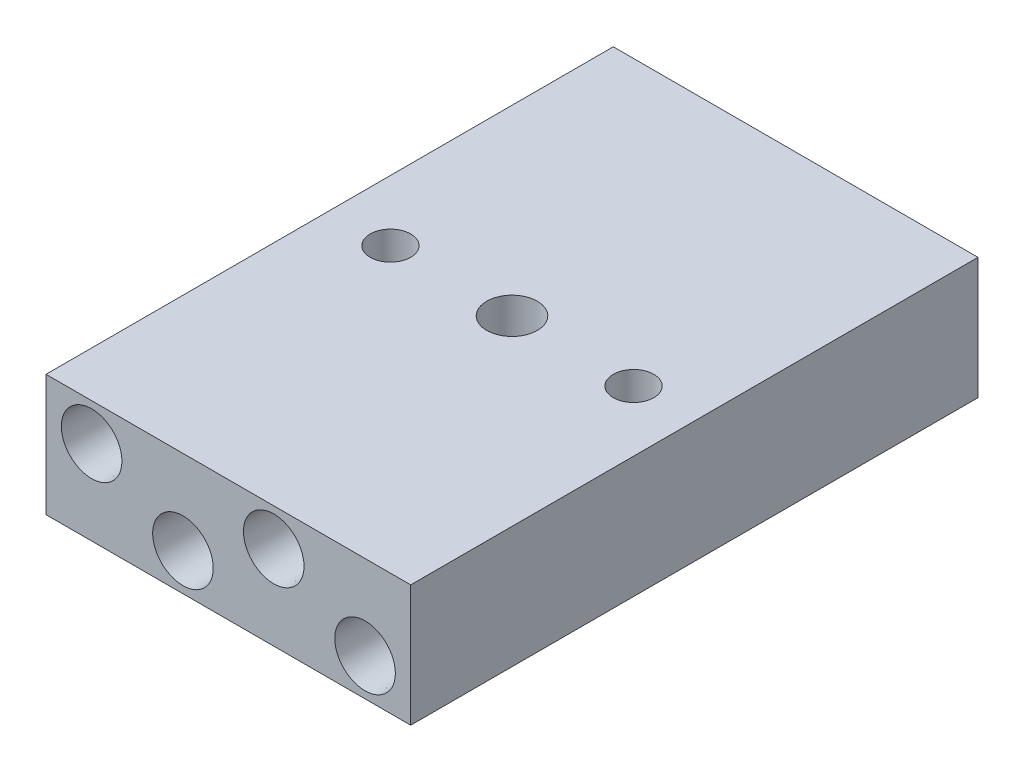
from build123d import *

# Parameters (mm, degrees)
SKETCH1_W                         = 57.15
SKETCH1_H                         = 19.05
EXTRUDE1_DEPTH                    = 88.9
F_1_8_NPT_TAPPED_HOLE1_AT_2_COUNT = 2
F_1_8_NPT_TAPPED_HOLE1_AT_2_PITCH = 16.097113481
F_1_8_NPT_TAPPED_HOLE1_AT_3_COUNT = 2
F_1_8_NPT_TAPPED_HOLE1_AT_3_PITCH = 28.5369
F_1_8_NPT_TAPPED_HOLE1_AT_4_COUNT = 2
F_1_8_NPT_TAPPED_HOLE1_AT_4_PITCH = 43.478308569
SKETCH3_R                         = 3.96875
CUT_EXTRUDE1_DEPTH                = 96.302901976
SKETCH4_R                         = 3.175
CUT_EXTRUDE2_DEPTH                = 6.35


with BuildPart() as part:
    # Sketch1 → Extrude1 (new body)
    with BuildSketch(Plane.XY):
        Rectangle(SKETCH1_W, SKETCH1_H)
    extrude(amount=-EXTRUDE1_DEPTH)

    # Sketch2 → 1_8 NPT Tapped Hole1 (revolve, cut)
    with BuildSketch(Plane(origin=(-21.4249, 3.683, 0), x_dir=(0, -1, 0), z_dir=(1, 0, 0))):
        Polygon((0, 0), (0, 14.156457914), (4.2164, 11.6229892), (4.2164, 6.9239892), (4.537406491, 6.9239892), (4.74472, 0), align=None)
    f_1_8_npt_tapped_hole1 = revolve(axis=Axis((-21.4249, 3.683, 6.35), (0, 0, -1)), mode=Mode.SUBTRACT)

    # 1_8 NPT Tapped Hole1 at 2: 1_8 NPT Tapped Hole1 ×2
    with Locations(*[Vector(0.8891594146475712, -0.457597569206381, 0) * (i * F_1_8_NPT_TAPPED_HOLE1_AT_2_PITCH) for i in range(1, F_1_8_NPT_TAPPED_HOLE1_AT_2_COUNT)]):
        add(f_1_8_npt_tapped_hole1, mode=Mode.SUBTRACT)

    # 1_8 NPT Tapped Hole1 at 3: 1_8 NPT Tapped Hole1 ×2
    with Locations(*[(i * F_1_8_NPT_TAPPED_HOLE1_AT_3_PITCH, 0, 0) for i in range(1, F_1_8_NPT_TAPPED_HOLE1_AT_3_COUNT)]):
        add(f_1_8_npt_tapped_hole1, mode=Mode.SUBTRACT)

    # 1_8 NPT Tapped Hole1 at 4: 1_8 NPT Tapped Hole1 ×2
    with Locations(*[Vector(0.9855443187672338, -0.16941781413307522, 0) * (i * F_1_8_NPT_TAPPED_HOLE1_AT_4_PITCH) for i in range(1, F_1_8_NPT_TAPPED_HOLE1_AT_4_COUNT)]):
        add(f_1_8_npt_tapped_hole1, mode=Mode.SUBTRACT)

    # Sketch3 → Cut-Extrude1 (cut, through all)
    with BuildSketch(Plane.XZ.offset(9.525)):
        with Locations(Location((0, -44.45, 0), (0, 0, 270))):
            Circle(SKETCH3_R)
    extrude(amount=-CUT_EXTRUDE1_DEPTH, mode=Mode.SUBTRACT)

    # Sketch4 → Cut-Extrude2 (cut)
    with BuildSketch(Plane(origin=(0, 9.525, 0), x_dir=(-1, 0, 0), z_dir=(0, 1, 0))):
        with Locations(Location((19.05, -44.45, 0), (0, 0, 90))):
            Circle(SKETCH4_R)
        with Locations(Location((-19.05, -44.45, 0), (0, 0, 270))):
            Circle(SKETCH4_R)
    extrude(amount=-CUT_EXTRUDE2_DEPTH, mode=Mode.SUBTRACT)


solid = part.part
